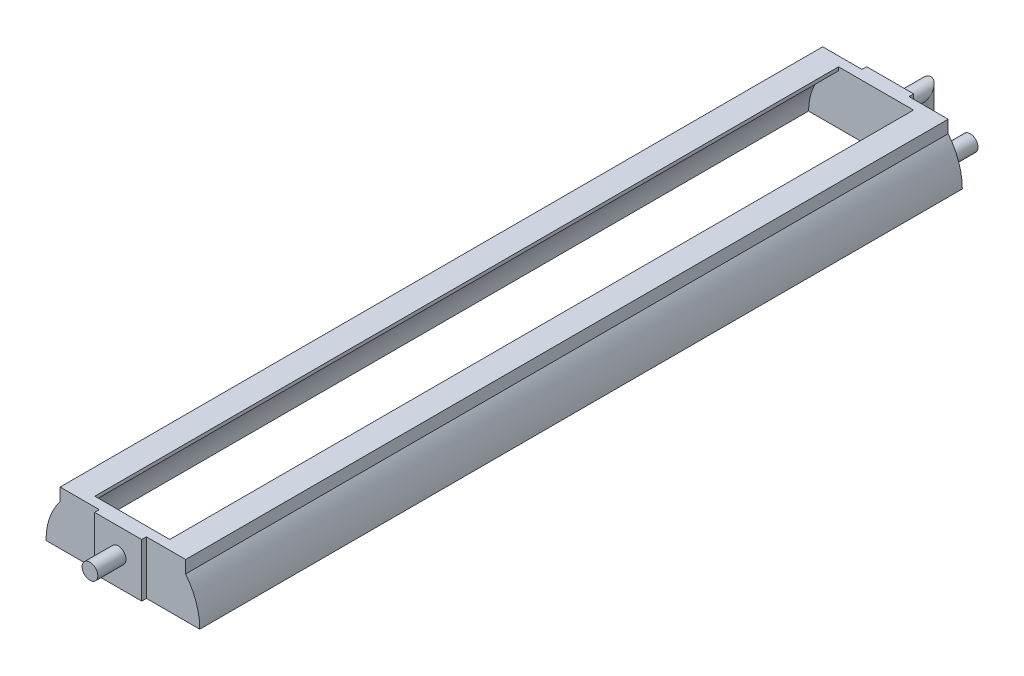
ISO-10303-21;
HEADER;
FILE_DESCRIPTION(('STEP AP214'),'2;1');
FILE_NAME('part.step','',(''),(''),'','','');
FILE_SCHEMA(('AUTOMOTIVE_DESIGN { 1 0 10303 214 1 1 1 1 }'));
ENDSEC;
DATA;
#1=APPLICATION_CONTEXT('core data for automotive mechanical design processes');
#2=APPLICATION_PROTOCOL_DEFINITION('international standard','automotive_design',2000,#1);
#3=PRODUCT_CONTEXT('',#1,'mechanical');
#4=PRODUCT('Part','Part','',(#3));
#5=PRODUCT_RELATED_PRODUCT_CATEGORY('part','',(#4));
#6=PRODUCT_DEFINITION_FORMATION('','',#4);
#7=PRODUCT_DEFINITION_CONTEXT('part definition',#1,'design');
#8=PRODUCT_DEFINITION('design','',#6,#7);
#9=PRODUCT_DEFINITION_SHAPE('','',#8);
#10=(LENGTH_UNIT() NAMED_UNIT(*) SI_UNIT(.MILLI.,.METRE.));
#11=(NAMED_UNIT(*) PLANE_ANGLE_UNIT() SI_UNIT($,.RADIAN.));
#12=(NAMED_UNIT(*) SI_UNIT($,.STERADIAN.) SOLID_ANGLE_UNIT());
#13=UNCERTAINTY_MEASURE_WITH_UNIT(LENGTH_MEASURE(1.E-05),#10,'distance_accuracy_value','');
#14=(GEOMETRIC_REPRESENTATION_CONTEXT(3) GLOBAL_UNCERTAINTY_ASSIGNED_CONTEXT((#13)) GLOBAL_UNIT_ASSIGNED_CONTEXT((#10,
#11,#12)) REPRESENTATION_CONTEXT('',''));
#15=CARTESIAN_POINT('',(0.,0.,0.));
#16=DIRECTION('',(0.,0.,1.));
#17=DIRECTION('',(1.,0.,0.));
#18=AXIS2_PLACEMENT_3D('',#15,#16,#17);
#19=CARTESIAN_POINT('',(0.,-10.5,-136.));
#20=DIRECTION('',(0.,0.,-1.));
#21=DIRECTION('',(-1.,0.,0.));
#22=AXIS2_PLACEMENT_3D('',#19,#20,#21);
#23=PLANE('',#22);
#24=CARTESIAN_POINT('',(0.,-13.,-136.));
#25=DIRECTION('',(0.,0.,1.));
#26=DIRECTION('',(1.,0.,0.));
#27=AXIS2_PLACEMENT_3D('',#24,#25,#26);
#28=CIRCLE('',#27,2.5);
#29=CARTESIAN_POINT('',(2.5,-13.,-136.));
#30=VERTEX_POINT('',#29);
#31=EDGE_CURVE('E12',#30,#30,#28,.T.);
#32=ORIENTED_EDGE('',*,*,#31,.F.);
#33=EDGE_LOOP('',(#32));
#34=FACE_BOUND('',#33,.T.);
#35=CARTESIAN_POINT('',(0.,-13.,-136.));
#36=DIRECTION('',(0.,0.,1.));
#37=DIRECTION('',(1.,0.,0.));
#38=AXIS2_PLACEMENT_3D('',#35,#36,#37);
#39=CIRCLE('',#38,3.);
#40=CARTESIAN_POINT('',(3.,-13.,-136.));
#41=VERTEX_POINT('',#40);
#42=EDGE_CURVE('E59',#41,#41,#39,.T.);
#43=ORIENTED_EDGE('',*,*,#42,.T.);
#44=EDGE_LOOP('',(#43));
#45=FACE_BOUND('',#44,.T.);
#46=ADVANCED_FACE('F45',(#34,#45),#23,.F.);
#47=CARTESIAN_POINT('',(0.,-13.,-131.));
#48=DIRECTION('',(0.,0.,1.));
#49=DIRECTION('',(1.,0.,0.));
#50=AXIS2_PLACEMENT_3D('',#47,#48,#49);
#51=CYLINDRICAL_SURFACE('',#50,2.5);
#52=CARTESIAN_POINT('',(0.,-13.,-138.));
#53=DIRECTION('',(0.,0.,1.));
#54=DIRECTION('',(1.,0.,0.));
#55=AXIS2_PLACEMENT_3D('',#52,#53,#54);
#56=CIRCLE('',#55,2.5);
#57=CARTESIAN_POINT('',(2.5,-13.,-138.));
#58=VERTEX_POINT('',#57);
#59=EDGE_CURVE('E51',#58,#58,#56,.T.);
#60=ORIENTED_EDGE('',*,*,#59,.F.);
#61=EDGE_LOOP('',(#60));
#62=FACE_BOUND('',#61,.T.);
#63=ORIENTED_EDGE('',*,*,#31,.T.);
#64=EDGE_LOOP('',(#63));
#65=FACE_BOUND('',#64,.T.);
#66=ADVANCED_FACE('F74',(#62,#65),#51,.F.);
#67=CARTESIAN_POINT('',(0.,-10.5,-138.));
#68=DIRECTION('',(0.,0.,1.));
#69=DIRECTION('',(1.,0.,0.));
#70=AXIS2_PLACEMENT_3D('',#67,#68,#69);
#71=PLANE('',#70);
#72=CARTESIAN_POINT('',(0.,-13.,-138.));
#73=DIRECTION('',(0.,0.,1.));
#74=DIRECTION('',(1.,0.,0.));
#75=AXIS2_PLACEMENT_3D('',#72,#73,#74);
#76=CIRCLE('',#75,3.);
#77=CARTESIAN_POINT('',(3.,-13.,-138.));
#78=VERTEX_POINT('',#77);
#79=EDGE_CURVE('E55',#78,#78,#76,.T.);
#80=ORIENTED_EDGE('',*,*,#79,.F.);
#81=EDGE_LOOP('',(#80));
#82=FACE_BOUND('',#81,.T.);
#83=ORIENTED_EDGE('',*,*,#59,.T.);
#84=EDGE_LOOP('',(#83));
#85=FACE_BOUND('',#84,.T.);
#86=ADVANCED_FACE('F69',(#82,#85),#71,.F.);
#87=CARTESIAN_POINT('',(0.,-13.,-137.));
#88=DIRECTION('',(0.,0.,1.));
#89=DIRECTION('',(1.,0.,0.));
#90=AXIS2_PLACEMENT_3D('',#87,#88,#89);
#91=TOROIDAL_SURFACE('',#90,3.,1.);
#92=ORIENTED_EDGE('',*,*,#42,.F.);
#93=EDGE_LOOP('',(#92));
#94=FACE_BOUND('',#93,.T.);
#95=ORIENTED_EDGE('',*,*,#79,.T.);
#96=EDGE_LOOP('',(#95));
#97=FACE_BOUND('',#96,.T.);
#98=ADVANCED_FACE('F66',(#94,#97),#91,.T.);
#99=CLOSED_SHELL('',(#46,#66,#86,#98));
#100=MANIFOLD_SOLID_BREP('B2',#99);
#101=CARTESIAN_POINT('',(0.,0.,-123.));
#102=DIRECTION('',(0.,0.,1.));
#103=DIRECTION('',(1.,0.,0.));
#104=AXIS2_PLACEMENT_3D('',#101,#102,#103);
#105=PLANE('',#104);
#106=DIRECTION('',(0.,-1.,0.));
#107=VECTOR('',#106,1.);
#108=CARTESIAN_POINT('',(7.49999999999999,0.,-123.));
#109=LINE('',#108,#107);
#110=CARTESIAN_POINT('',(7.49999999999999,17.,-123.));
#111=VERTEX_POINT('',#110);
#112=CARTESIAN_POINT('',(7.49999999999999,0.,-123.));
#113=VERTEX_POINT('',#112);
#114=EDGE_CURVE('E473',#111,#113,#109,.T.);
#115=ORIENTED_EDGE('',*,*,#114,.T.);
#116=DIRECTION('',(-1.,0.,0.));
#117=VECTOR('',#116,1.);
#118=CARTESIAN_POINT('',(7.49999999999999,0.,-123.));
#119=LINE('',#118,#117);
#120=CARTESIAN_POINT('',(-7.49999999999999,0.,-123.));
#121=VERTEX_POINT('',#120);
#122=EDGE_CURVE('E472',#113,#121,#119,.T.);
#123=ORIENTED_EDGE('',*,*,#122,.T.);
#124=DIRECTION('',(0.,1.,0.));
#125=VECTOR('',#124,1.);
#126=CARTESIAN_POINT('',(-7.49999999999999,17.,-123.));
#127=LINE('',#126,#125);
#128=CARTESIAN_POINT('',(-7.49999999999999,17.,-123.));
#129=VERTEX_POINT('',#128);
#130=EDGE_CURVE('E470',#121,#129,#127,.T.);
#131=ORIENTED_EDGE('',*,*,#130,.T.);
#132=DIRECTION('',(1.,0.,0.));
#133=VECTOR('',#132,1.);
#134=CARTESIAN_POINT('',(7.49999999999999,17.,-123.));
#135=LINE('',#134,#133);
#136=EDGE_CURVE('E462',#129,#111,#135,.T.);
#137=ORIENTED_EDGE('',*,*,#136,.T.);
#138=EDGE_LOOP('',(#115,#123,#131,#137));
#139=FACE_BOUND('',#138,.T.);
#140=CARTESIAN_POINT('',(0.,9.,-123.));
#141=DIRECTION('',(0.,0.,1.));
#142=DIRECTION('',(1.,0.,0.));
#143=AXIS2_PLACEMENT_3D('',#140,#141,#142);
#144=CIRCLE('',#143,2.5);
#145=CARTESIAN_POINT('',(2.5,9.,-123.));
#146=VERTEX_POINT('',#145);
#147=EDGE_CURVE('E43',#146,#146,#144,.F.);
#148=ORIENTED_EDGE('',*,*,#147,.F.);
#149=EDGE_LOOP('',(#148));
#150=FACE_BOUND('',#149,.T.);
#151=ADVANCED_FACE('F107',(#139,#150),#105,.F.);
#152=CARTESIAN_POINT('',(0.,0.,123.));
#153=DIRECTION('',(0.,0.,1.));
#154=DIRECTION('',(1.,0.,0.));
#155=AXIS2_PLACEMENT_3D('',#152,#153,#154);
#156=PLANE('',#155);
#157=DIRECTION('',(0.,-1.,0.));
#158=VECTOR('',#157,1.);
#159=CARTESIAN_POINT('',(7.50000000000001,0.,123.));
#160=LINE('',#159,#158);
#161=CARTESIAN_POINT('',(7.50000000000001,17.,123.));
#162=VERTEX_POINT('',#161);
#163=CARTESIAN_POINT('',(7.50000000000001,0.,123.));
#164=VERTEX_POINT('',#163);
#165=EDGE_CURVE('E250',#162,#164,#160,.T.);
#166=ORIENTED_EDGE('',*,*,#165,.F.);
#167=DIRECTION('',(-1.,0.,0.));
#168=VECTOR('',#167,1.);
#169=CARTESIAN_POINT('',(0.,17.,123.));
#170=LINE('',#169,#168);
#171=CARTESIAN_POINT('',(-7.49999999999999,17.,123.));
#172=VERTEX_POINT('',#171);
#173=EDGE_CURVE('E257',#162,#172,#170,.T.);
#174=ORIENTED_EDGE('',*,*,#173,.T.);
#175=DIRECTION('',(0.,-1.,0.));
#176=VECTOR('',#175,1.);
#177=CARTESIAN_POINT('',(-7.49999999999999,0.,123.));
#178=LINE('',#177,#176);
#179=CARTESIAN_POINT('',(-7.49999999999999,0.,123.));
#180=VERTEX_POINT('',#179);
#181=EDGE_CURVE('E264',#172,#180,#178,.T.);
#182=ORIENTED_EDGE('',*,*,#181,.T.);
#183=DIRECTION('',(1.,0.,0.));
#184=VECTOR('',#183,1.);
#185=CARTESIAN_POINT('',(0.,0.,123.));
#186=LINE('',#185,#184);
#187=EDGE_CURVE('E269',#180,#164,#186,.T.);
#188=ORIENTED_EDGE('',*,*,#187,.T.);
#189=EDGE_LOOP('',(#166,#174,#182,#188));
#190=FACE_BOUND('',#189,.T.);
#191=CARTESIAN_POINT('',(0.,8.9999999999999,123.));
#192=DIRECTION('',(0.,0.,1.));
#193=DIRECTION('',(1.,0.,0.));
#194=AXIS2_PLACEMENT_3D('',#191,#192,#193);
#195=CIRCLE('',#194,2.50384678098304);
#196=CARTESIAN_POINT('',(2.50384678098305,8.9999999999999,123.));
#197=VERTEX_POINT('',#196);
#198=EDGE_CURVE('E274',#197,#197,#195,.T.);
#199=ORIENTED_EDGE('',*,*,#198,.F.);
#200=EDGE_LOOP('',(#199));
#201=FACE_BOUND('',#200,.T.);
#202=ADVANCED_FACE('F266',(#190,#201),#156,.T.);
#203=CARTESIAN_POINT('',(3.49999999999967,-1.87350135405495E-13,121.5));
#204=DIRECTION('',(0.,0.,-1.));
#205=DIRECTION('',(-1.,0.,0.));
#206=AXIS2_PLACEMENT_3D('',#203,#204,#205);
#207=PLANE('',#206);
#208=DIRECTION('',(0.,-1.,0.));
#209=VECTOR('',#208,1.);
#210=CARTESIAN_POINT('',(-7.49999999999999,0.,121.5));
#211=LINE('',#210,#209);
#212=CARTESIAN_POINT('',(-7.49999999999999,17.,121.5));
#213=VERTEX_POINT('',#212);
#214=CARTESIAN_POINT('',(-7.49999999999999,0.,121.5));
#215=VERTEX_POINT('',#214);
#216=EDGE_CURVE('E123',#213,#215,#211,.T.);
#217=ORIENTED_EDGE('',*,*,#216,.F.);
#218=DIRECTION('',(-1.,0.,0.));
#219=VECTOR('',#218,1.);
#220=CARTESIAN_POINT('',(-19.9924225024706,17.,121.5));
#221=LINE('',#220,#219);
#222=CARTESIAN_POINT('',(-19.9924225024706,17.,121.5));
#223=VERTEX_POINT('',#222);
#224=EDGE_CURVE('E303',#213,#223,#221,.T.);
#225=ORIENTED_EDGE('',*,*,#224,.T.);
#226=DIRECTION('',(0.,-1.,0.));
#227=VECTOR('',#226,1.);
#228=CARTESIAN_POINT('',(-19.9924225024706,13.,121.5));
#229=LINE('',#228,#227);
#230=CARTESIAN_POINT('',(-19.9924225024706,13.,121.5));
#231=VERTEX_POINT('',#230);
#232=EDGE_CURVE('E353',#223,#231,#229,.T.);
#233=ORIENTED_EDGE('',*,*,#232,.T.);
#234=CARTESIAN_POINT('',(-3.5,0.,121.5));
#235=DIRECTION('',(0.,0.,1.));
#236=DIRECTION('',(1.,0.,0.));
#237=AXIS2_PLACEMENT_3D('',#234,#235,#236);
#238=CIRCLE('',#237,21.);
#239=CARTESIAN_POINT('',(-24.5,-1.46642216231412E-13,121.5));
#240=VERTEX_POINT('',#239);
#241=EDGE_CURVE('E404',#231,#240,#238,.T.);
#242=ORIENTED_EDGE('',*,*,#241,.T.);
#243=DIRECTION('',(1.,0.,0.));
#244=VECTOR('',#243,1.);
#245=CARTESIAN_POINT('',(-24.5,-1.46642216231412E-13,121.5));
#246=LINE('',#245,#244);
#247=EDGE_CURVE('E397',#240,#215,#246,.T.);
#248=ORIENTED_EDGE('',*,*,#247,.T.);
#249=EDGE_LOOP('',(#217,#225,#233,#242,#248));
#250=FACE_BOUND('',#249,.T.);
#251=ADVANCED_FACE('F513',(#250),#207,.F.);
#252=CARTESIAN_POINT('',(3.4999999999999,0.,-121.5));
#253=DIRECTION('',(0.,0.,1.));
#254=DIRECTION('',(1.,0.,0.));
#255=AXIS2_PLACEMENT_3D('',#252,#253,#254);
#256=PLANE('',#255);
#257=DIRECTION('',(0.,-1.,0.));
#258=VECTOR('',#257,1.);
#259=CARTESIAN_POINT('',(7.49999999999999,0.,-121.5));
#260=LINE('',#259,#258);
#261=CARTESIAN_POINT('',(7.49999999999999,17.,-121.5));
#262=VERTEX_POINT('',#261);
#263=CARTESIAN_POINT('',(7.49999999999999,0.,-121.5));
#264=VERTEX_POINT('',#263);
#265=EDGE_CURVE('E253',#262,#264,#260,.T.);
#266=ORIENTED_EDGE('',*,*,#265,.F.);
#267=DIRECTION('',(1.,0.,0.));
#268=VECTOR('',#267,1.);
#269=CARTESIAN_POINT('',(-19.9924225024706,17.,-121.5));
#270=LINE('',#269,#268);
#271=CARTESIAN_POINT('',(19.9924225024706,17.,-121.5));
#272=VERTEX_POINT('',#271);
#273=EDGE_CURVE('E358',#262,#272,#270,.T.);
#274=ORIENTED_EDGE('',*,*,#273,.T.);
#275=DIRECTION('',(0.,-1.,0.));
#276=VECTOR('',#275,1.);
#277=CARTESIAN_POINT('',(19.9924225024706,17.,-121.5));
#278=LINE('',#277,#276);
#279=CARTESIAN_POINT('',(19.9924225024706,13.,-121.5));
#280=VERTEX_POINT('',#279);
#281=EDGE_CURVE('E357',#272,#280,#278,.T.);
#282=ORIENTED_EDGE('',*,*,#281,.T.);
#283=CARTESIAN_POINT('',(3.4999999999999,0.,-121.5));
#284=DIRECTION('',(0.,0.,-1.));
#285=DIRECTION('',(1.,0.,0.));
#286=AXIS2_PLACEMENT_3D('',#283,#284,#285);
#287=CIRCLE('',#286,21.0000000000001);
#288=CARTESIAN_POINT('',(24.5,0.,-121.5));
#289=VERTEX_POINT('',#288);
#290=EDGE_CURVE('E368',#280,#289,#287,.T.);
#291=ORIENTED_EDGE('',*,*,#290,.T.);
#292=DIRECTION('',(-1.,0.,0.));
#293=VECTOR('',#292,1.);
#294=CARTESIAN_POINT('',(-24.5,0.,-121.5));
#295=LINE('',#294,#293);
#296=EDGE_CURVE('E379',#289,#264,#295,.T.);
#297=ORIENTED_EDGE('',*,*,#296,.T.);
#298=EDGE_LOOP('',(#266,#274,#282,#291,#297));
#299=FACE_BOUND('',#298,.T.);
#300=ADVANCED_FACE('F493',(#299),#256,.F.);
#301=DIRECTION('',(0.,1.,0.));
#302=VECTOR('',#301,1.);
#303=CARTESIAN_POINT('',(-7.49999999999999,17.,-121.5));
#304=LINE('',#303,#302);
#305=CARTESIAN_POINT('',(-7.49999999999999,0.,-121.5));
#306=VERTEX_POINT('',#305);
#307=CARTESIAN_POINT('',(-7.49999999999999,17.,-121.5));
#308=VERTEX_POINT('',#307);
#309=EDGE_CURVE('E393',#306,#308,#304,.T.);
#310=ORIENTED_EDGE('',*,*,#309,.F.);
#311=CARTESIAN_POINT('',(-24.5,0.,-121.5));
#312=VERTEX_POINT('',#311);
#313=EDGE_CURVE('E371',#306,#312,#295,.T.);
#314=ORIENTED_EDGE('',*,*,#313,.T.);
#315=CARTESIAN_POINT('',(-3.50000000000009,0.,-121.5));
#316=DIRECTION('',(0.,0.,-1.));
#317=DIRECTION('',(-1.,0.,0.));
#318=AXIS2_PLACEMENT_3D('',#315,#316,#317);
#319=CIRCLE('',#318,20.9999999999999);
#320=CARTESIAN_POINT('',(-19.9924225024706,13.,-121.5));
#321=VERTEX_POINT('',#320);
#322=EDGE_CURVE('E374',#312,#321,#319,.T.);
#323=ORIENTED_EDGE('',*,*,#322,.T.);
#324=DIRECTION('',(0.,1.,0.));
#325=VECTOR('',#324,1.);
#326=CARTESIAN_POINT('',(-19.9924225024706,13.,-121.5));
#327=LINE('',#326,#325);
#328=CARTESIAN_POINT('',(-19.9924225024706,17.,-121.5));
#329=VERTEX_POINT('',#328);
#330=EDGE_CURVE('E384',#321,#329,#327,.T.);
#331=ORIENTED_EDGE('',*,*,#330,.T.);
#332=EDGE_CURVE('E354',#329,#308,#270,.T.);
#333=ORIENTED_EDGE('',*,*,#332,.T.);
#334=EDGE_LOOP('',(#310,#314,#323,#331,#333));
#335=FACE_BOUND('',#334,.T.);
#336=ADVANCED_FACE('F388',(#335),#256,.F.);
#337=CARTESIAN_POINT('',(-3.5,0.,-118.5));
#338=DIRECTION('',(0.,0.,1.));
#339=DIRECTION('',(1.,0.,0.));
#340=AXIS2_PLACEMENT_3D('',#337,#338,#339);
#341=CYLINDRICAL_SURFACE('',#340,18.);
#342=DIRECTION('',(0.,0.,1.));
#343=VECTOR('',#342,1.);
#344=CARTESIAN_POINT('',(-11.9440829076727,15.8964607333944,-118.5));
#345=LINE('',#344,#343);
#346=CARTESIAN_POINT('',(-11.9440829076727,15.8964607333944,-118.5));
#347=VERTEX_POINT('',#346);
#348=CARTESIAN_POINT('',(-11.9440829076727,15.8964607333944,118.5));
#349=VERTEX_POINT('',#348);
#350=EDGE_CURVE('E336',#347,#349,#345,.T.);
#351=ORIENTED_EDGE('',*,*,#350,.T.);
#352=CARTESIAN_POINT('',(-3.5,0.,118.5));
#353=DIRECTION('',(0.,0.,-1.));
#354=DIRECTION('',(-1.,0.,0.));
#355=AXIS2_PLACEMENT_3D('',#352,#353,#354);
#356=CIRCLE('',#355,18.);
#357=CARTESIAN_POINT('',(-21.5,0.,118.5));
#358=VERTEX_POINT('',#357);
#359=EDGE_CURVE('E335',#358,#349,#356,.T.);
#360=ORIENTED_EDGE('',*,*,#359,.F.);
#361=DIRECTION('',(0.,0.,1.));
#362=VECTOR('',#361,1.);
#363=CARTESIAN_POINT('',(-21.5,0.,-118.5));
#364=LINE('',#363,#362);
#365=CARTESIAN_POINT('',(-21.5,0.,-118.5));
#366=VERTEX_POINT('',#365);
#367=EDGE_CURVE('E116',#366,#358,#364,.T.);
#368=ORIENTED_EDGE('',*,*,#367,.F.);
#369=CARTESIAN_POINT('',(-3.5,0.,-118.5));
#370=DIRECTION('',(0.,0.,-1.));
#371=DIRECTION('',(-1.,0.,0.));
#372=AXIS2_PLACEMENT_3D('',#369,#370,#371);
#373=CIRCLE('',#372,18.);
#374=EDGE_CURVE('E328',#366,#347,#373,.T.);
#375=ORIENTED_EDGE('',*,*,#374,.T.);
#376=EDGE_LOOP('',(#351,#360,#368,#375));
#377=FACE_BOUND('',#376,.T.);
#378=ADVANCED_FACE('F109',(#377),#341,.F.);
#379=CARTESIAN_POINT('',(-21.5,0.,-118.5));
#380=DIRECTION('',(0.,-1.,0.));
#381=DIRECTION('',(0.,0.,-1.));
#382=AXIS2_PLACEMENT_3D('',#379,#380,#381);
#383=PLANE('',#382);
#384=DIRECTION('',(-1.,0.,0.));
#385=VECTOR('',#384,1.);
#386=CARTESIAN_POINT('',(-24.5,0.,-118.5));
#387=LINE('',#386,#385);
#388=CARTESIAN_POINT('',(21.5,0.,-118.5));
#389=VERTEX_POINT('',#388);
#390=EDGE_CURVE('E422',#389,#366,#387,.T.);
#391=ORIENTED_EDGE('',*,*,#390,.T.);
#392=ORIENTED_EDGE('',*,*,#367,.T.);
#393=DIRECTION('',(1.,0.,0.));
#394=VECTOR('',#393,1.);
#395=CARTESIAN_POINT('',(-24.5,-1.46642216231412E-13,118.5));
#396=LINE('',#395,#394);
#397=CARTESIAN_POINT('',(21.5,0.,118.5));
#398=VERTEX_POINT('',#397);
#399=EDGE_CURVE('E318',#358,#398,#396,.T.);
#400=ORIENTED_EDGE('',*,*,#399,.T.);
#401=DIRECTION('',(0.,0.,1.));
#402=VECTOR('',#401,1.);
#403=CARTESIAN_POINT('',(21.5,0.,-118.5));
#404=LINE('',#403,#402);
#405=EDGE_CURVE('E323',#389,#398,#404,.T.);
#406=ORIENTED_EDGE('',*,*,#405,.F.);
#407=EDGE_LOOP('',(#391,#392,#400,#406));
#408=FACE_BOUND('',#407,.T.);
#409=DIRECTION('',(0.,0.,1.));
#410=VECTOR('',#409,1.);
#411=CARTESIAN_POINT('',(-24.5,0.,-118.5));
#412=LINE('',#411,#410);
#413=EDGE_CURVE('E345',#312,#240,#412,.T.);
#414=ORIENTED_EDGE('',*,*,#413,.F.);
#415=ORIENTED_EDGE('',*,*,#313,.F.);
#416=DIRECTION('',(0.,0.,1.));
#417=VECTOR('',#416,1.);
#418=CARTESIAN_POINT('',(-7.49999999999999,0.,-123.));
#419=LINE('',#418,#417);
#420=EDGE_CURVE('E483',#121,#306,#419,.T.);
#421=ORIENTED_EDGE('',*,*,#420,.F.);
#422=ORIENTED_EDGE('',*,*,#122,.F.);
#423=DIRECTION('',(0.,0.,1.));
#424=VECTOR('',#423,1.);
#425=CARTESIAN_POINT('',(7.49999999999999,0.,-123.));
#426=LINE('',#425,#424);
#427=EDGE_CURVE('E429',#113,#264,#426,.T.);
#428=ORIENTED_EDGE('',*,*,#427,.T.);
#429=ORIENTED_EDGE('',*,*,#296,.F.);
#430=DIRECTION('',(0.,0.,-1.));
#431=VECTOR('',#430,1.);
#432=CARTESIAN_POINT('',(24.5,0.,121.5));
#433=LINE('',#432,#431);
#434=CARTESIAN_POINT('',(24.5,0.,121.5));
#435=VERTEX_POINT('',#434);
#436=EDGE_CURVE('E324',#435,#289,#433,.T.);
#437=ORIENTED_EDGE('',*,*,#436,.F.);
#438=CARTESIAN_POINT('',(7.50000000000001,0.,121.5));
#439=VERTEX_POINT('',#438);
#440=EDGE_CURVE('E450',#439,#435,#246,.T.);
#441=ORIENTED_EDGE('',*,*,#440,.F.);
#442=DIRECTION('',(0.,0.,-1.));
#443=VECTOR('',#442,1.);
#444=CARTESIAN_POINT('',(7.50000000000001,0.,123.));
#445=LINE('',#444,#443);
#446=EDGE_CURVE('E279',#164,#439,#445,.T.);
#447=ORIENTED_EDGE('',*,*,#446,.F.);
#448=ORIENTED_EDGE('',*,*,#187,.F.);
#449=DIRECTION('',(0.,0.,-1.));
#450=VECTOR('',#449,1.);
#451=CARTESIAN_POINT('',(-7.49999999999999,0.,123.));
#452=LINE('',#451,#450);
#453=EDGE_CURVE('E290',#180,#215,#452,.T.);
#454=ORIENTED_EDGE('',*,*,#453,.T.);
#455=ORIENTED_EDGE('',*,*,#247,.F.);
#456=EDGE_LOOP('',(#414,#415,#421,#422,#428,#429,#437,#441,#447,#448,#454,#455));
#457=FACE_BOUND('',#456,.T.);
#458=ADVANCED_FACE('F396',(#408,#457),#383,.T.);
#459=CARTESIAN_POINT('',(-3.5,0.,-118.5));
#460=DIRECTION('',(0.,0.,1.));
#461=DIRECTION('',(1.,0.,0.));
#462=AXIS2_PLACEMENT_3D('',#459,#460,#461);
#463=CYLINDRICAL_SURFACE('',#462,21.);
#464=ORIENTED_EDGE('',*,*,#413,.T.);
#465=ORIENTED_EDGE('',*,*,#241,.F.);
#466=DIRECTION('',(0.,0.,1.));
#467=VECTOR('',#466,1.);
#468=CARTESIAN_POINT('',(-19.9924225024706,13.,-118.5));
#469=LINE('',#468,#467);
#470=EDGE_CURVE('E401',#321,#231,#469,.T.);
#471=ORIENTED_EDGE('',*,*,#470,.F.);
#472=ORIENTED_EDGE('',*,*,#322,.F.);
#473=EDGE_LOOP('',(#464,#465,#471,#472));
#474=FACE_BOUND('',#473,.T.);
#475=ADVANCED_FACE('F403',(#474),#463,.T.);
#476=CARTESIAN_POINT('',(-19.9924225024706,13.,-118.5));
#477=DIRECTION('',(-1.,0.,0.));
#478=DIRECTION('',(0.,0.,1.));
#479=AXIS2_PLACEMENT_3D('',#476,#477,#478);
#480=PLANE('',#479);
#481=ORIENTED_EDGE('',*,*,#470,.T.);
#482=ORIENTED_EDGE('',*,*,#232,.F.);
#483=DIRECTION('',(0.,0.,1.));
#484=VECTOR('',#483,1.);
#485=CARTESIAN_POINT('',(-19.9924225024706,17.,-118.5));
#486=LINE('',#485,#484);
#487=EDGE_CURVE('E341',#329,#223,#486,.T.);
#488=ORIENTED_EDGE('',*,*,#487,.F.);
#489=ORIENTED_EDGE('',*,*,#330,.F.);
#490=EDGE_LOOP('',(#481,#482,#488,#489));
#491=FACE_BOUND('',#490,.T.);
#492=ADVANCED_FACE('F570',(#491),#480,.T.);
#493=CARTESIAN_POINT('',(-11.9440829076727,17.,-118.5));
#494=DIRECTION('',(0.,1.,0.));
#495=DIRECTION('',(0.,0.,1.));
#496=AXIS2_PLACEMENT_3D('',#493,#494,#495);
#497=PLANE('',#496);
#498=ORIENTED_EDGE('',*,*,#332,.F.);
#499=ORIENTED_EDGE('',*,*,#487,.T.);
#500=ORIENTED_EDGE('',*,*,#224,.F.);
#501=DIRECTION('',(0.,0.,-1.));
#502=VECTOR('',#501,1.);
#503=CARTESIAN_POINT('',(-7.49999999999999,17.,123.));
#504=LINE('',#503,#502);
#505=EDGE_CURVE('E254',#172,#213,#504,.T.);
#506=ORIENTED_EDGE('',*,*,#505,.F.);
#507=ORIENTED_EDGE('',*,*,#173,.F.);
#508=DIRECTION('',(0.,0.,-1.));
#509=VECTOR('',#508,1.);
#510=CARTESIAN_POINT('',(7.50000000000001,17.,123.));
#511=LINE('',#510,#509);
#512=CARTESIAN_POINT('',(7.50000000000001,17.,121.5));
#513=VERTEX_POINT('',#512);
#514=EDGE_CURVE('E245',#162,#513,#511,.T.);
#515=ORIENTED_EDGE('',*,*,#514,.T.);
#516=CARTESIAN_POINT('',(19.9924225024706,17.,121.5));
#517=VERTEX_POINT('',#516);
#518=EDGE_CURVE('E131',#517,#513,#221,.T.);
#519=ORIENTED_EDGE('',*,*,#518,.F.);
#520=DIRECTION('',(0.,0.,-1.));
#521=VECTOR('',#520,1.);
#522=CARTESIAN_POINT('',(19.9924225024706,17.,121.5));
#523=LINE('',#522,#521);
#524=EDGE_CURVE('E497',#517,#272,#523,.T.);
#525=ORIENTED_EDGE('',*,*,#524,.T.);
#526=ORIENTED_EDGE('',*,*,#273,.F.);
#527=DIRECTION('',(0.,0.,1.));
#528=VECTOR('',#527,1.);
#529=CARTESIAN_POINT('',(7.49999999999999,17.,-123.));
#530=LINE('',#529,#528);
#531=EDGE_CURVE('E458',#111,#262,#530,.T.);
#532=ORIENTED_EDGE('',*,*,#531,.F.);
#533=ORIENTED_EDGE('',*,*,#136,.F.);
#534=DIRECTION('',(0.,0.,1.));
#535=VECTOR('',#534,1.);
#536=CARTESIAN_POINT('',(-7.49999999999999,17.,-123.));
#537=LINE('',#536,#535);
#538=EDGE_CURVE('E461',#129,#308,#537,.T.);
#539=ORIENTED_EDGE('',*,*,#538,.T.);
#540=EDGE_LOOP('',(#498,#499,#500,#506,#507,#515,#519,#525,#526,#532,#533,#539));
#541=FACE_BOUND('',#540,.T.);
#542=DIRECTION('',(0.,0.,1.));
#543=VECTOR('',#542,1.);
#544=CARTESIAN_POINT('',(-11.9440829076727,17.,-118.5));
#545=LINE('',#544,#543);
#546=CARTESIAN_POINT('',(-11.9440829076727,17.,-118.5));
#547=VERTEX_POINT('',#546);
#548=CARTESIAN_POINT('',(-11.9440829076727,17.,118.5));
#549=VERTEX_POINT('',#548);
#550=EDGE_CURVE('E338',#547,#549,#545,.T.);
#551=ORIENTED_EDGE('',*,*,#550,.F.);
#552=DIRECTION('',(1.,0.,0.));
#553=VECTOR('',#552,1.);
#554=CARTESIAN_POINT('',(-19.9924225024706,17.,-118.5));
#555=LINE('',#554,#553);
#556=CARTESIAN_POINT('',(11.9440829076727,17.,-118.5));
#557=VERTEX_POINT('',#556);
#558=EDGE_CURVE('E426',#547,#557,#555,.T.);
#559=ORIENTED_EDGE('',*,*,#558,.T.);
#560=DIRECTION('',(0.,0.,1.));
#561=VECTOR('',#560,1.);
#562=CARTESIAN_POINT('',(11.9440829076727,17.,-118.5));
#563=LINE('',#562,#561);
#564=CARTESIAN_POINT('',(11.9440829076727,17.,118.5));
#565=VERTEX_POINT('',#564);
#566=EDGE_CURVE('E443',#557,#565,#563,.T.);
#567=ORIENTED_EDGE('',*,*,#566,.T.);
#568=DIRECTION('',(-1.,0.,0.));
#569=VECTOR('',#568,1.);
#570=CARTESIAN_POINT('',(-19.9924225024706,17.,118.5));
#571=LINE('',#570,#569);
#572=EDGE_CURVE('E322',#565,#549,#571,.T.);
#573=ORIENTED_EDGE('',*,*,#572,.T.);
#574=EDGE_LOOP('',(#551,#559,#567,#573));
#575=FACE_BOUND('',#574,.T.);
#576=ADVANCED_FACE('F259',(#541,#575),#497,.T.);
#577=CARTESIAN_POINT('',(-11.9440829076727,17.,-118.5));
#578=DIRECTION('',(1.,0.,0.));
#579=DIRECTION('',(0.,0.,-1.));
#580=AXIS2_PLACEMENT_3D('',#577,#578,#579);
#581=PLANE('',#580);
#582=ORIENTED_EDGE('',*,*,#550,.T.);
#583=DIRECTION('',(0.,1.,0.));
#584=VECTOR('',#583,1.);
#585=CARTESIAN_POINT('',(-11.9440829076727,17.,118.5));
#586=LINE('',#585,#584);
#587=EDGE_CURVE('E331',#349,#549,#586,.T.);
#588=ORIENTED_EDGE('',*,*,#587,.F.);
#589=ORIENTED_EDGE('',*,*,#350,.F.);
#590=DIRECTION('',(0.,1.,0.));
#591=VECTOR('',#590,1.);
#592=CARTESIAN_POINT('',(-11.9440829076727,17.,-118.5));
#593=LINE('',#592,#591);
#594=EDGE_CURVE('E410',#347,#547,#593,.T.);
#595=ORIENTED_EDGE('',*,*,#594,.T.);
#596=EDGE_LOOP('',(#582,#588,#589,#595));
#597=FACE_BOUND('',#596,.T.);
#598=ADVANCED_FACE('F561',(#597),#581,.T.);
#599=CARTESIAN_POINT('',(3.49999999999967,-1.87350135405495E-13,121.5));
#600=DIRECTION('',(0.,0.,-1.));
#601=DIRECTION('',(-1.,0.,0.));
#602=AXIS2_PLACEMENT_3D('',#599,#600,#601);
#603=CYLINDRICAL_SURFACE('',#602,21.0000000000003);
#604=ORIENTED_EDGE('',*,*,#436,.T.);
#605=ORIENTED_EDGE('',*,*,#290,.F.);
#606=DIRECTION('',(0.,0.,-1.));
#607=VECTOR('',#606,1.);
#608=CARTESIAN_POINT('',(19.9924225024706,13.,121.5));
#609=LINE('',#608,#607);
#610=CARTESIAN_POINT('',(19.9924225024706,13.,121.5));
#611=VERTEX_POINT('',#610);
#612=EDGE_CURVE('E501',#611,#280,#609,.T.);
#613=ORIENTED_EDGE('',*,*,#612,.F.);
#614=CARTESIAN_POINT('',(3.49999999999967,-1.87350135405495E-13,121.5));
#615=DIRECTION('',(0.,0.,1.));
#616=DIRECTION('',(-1.,0.,0.));
#617=AXIS2_PLACEMENT_3D('',#614,#615,#616);
#618=CIRCLE('',#617,21.0000000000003);
#619=EDGE_CURVE('E452',#435,#611,#618,.T.);
#620=ORIENTED_EDGE('',*,*,#619,.F.);
#621=EDGE_LOOP('',(#604,#605,#613,#620));
#622=FACE_BOUND('',#621,.T.);
#623=ADVANCED_FACE('F506',(#622),#603,.T.);
#624=CARTESIAN_POINT('',(19.9924225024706,17.,121.5));
#625=DIRECTION('',(-1.,0.,0.));
#626=DIRECTION('',(0.,0.,1.));
#627=AXIS2_PLACEMENT_3D('',#624,#625,#626);
#628=PLANE('',#627);
#629=ORIENTED_EDGE('',*,*,#612,.T.);
#630=ORIENTED_EDGE('',*,*,#281,.F.);
#631=ORIENTED_EDGE('',*,*,#524,.F.);
#632=DIRECTION('',(0.,1.,0.));
#633=VECTOR('',#632,1.);
#634=CARTESIAN_POINT('',(19.9924225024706,17.,121.5));
#635=LINE('',#634,#633);
#636=EDGE_CURVE('E306',#611,#517,#635,.T.);
#637=ORIENTED_EDGE('',*,*,#636,.F.);
#638=EDGE_LOOP('',(#629,#630,#631,#637));
#639=FACE_BOUND('',#638,.T.);
#640=ADVANCED_FACE('F502',(#639),#628,.F.);
#641=ORIENTED_EDGE('',*,*,#518,.T.);
#642=DIRECTION('',(0.,-1.,0.));
#643=VECTOR('',#642,1.);
#644=CARTESIAN_POINT('',(7.50000000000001,0.,121.5));
#645=LINE('',#644,#643);
#646=EDGE_CURVE('E251',#513,#439,#645,.T.);
#647=ORIENTED_EDGE('',*,*,#646,.T.);
#648=ORIENTED_EDGE('',*,*,#440,.T.);
#649=ORIENTED_EDGE('',*,*,#619,.T.);
#650=ORIENTED_EDGE('',*,*,#636,.T.);
#651=EDGE_LOOP('',(#641,#647,#648,#649,#650));
#652=FACE_BOUND('',#651,.T.);
#653=ADVANCED_FACE('F509',(#652),#207,.F.);
#654=CARTESIAN_POINT('',(3.49999999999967,-1.87350135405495E-13,118.5));
#655=DIRECTION('',(0.,0.,-1.));
#656=DIRECTION('',(-1.,0.,0.));
#657=AXIS2_PLACEMENT_3D('',#654,#655,#656);
#658=PLANE('',#657);
#659=CARTESIAN_POINT('',(3.5,0.,118.5));
#660=DIRECTION('',(0.,0.,-1.));
#661=DIRECTION('',(1.,0.,0.));
#662=AXIS2_PLACEMENT_3D('',#659,#660,#661);
#663=CIRCLE('',#662,18.);
#664=CARTESIAN_POINT('',(11.9440829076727,15.8964607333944,118.5));
#665=VERTEX_POINT('',#664);
#666=EDGE_CURVE('E435',#665,#398,#663,.T.);
#667=ORIENTED_EDGE('',*,*,#666,.T.);
#668=ORIENTED_EDGE('',*,*,#399,.F.);
#669=ORIENTED_EDGE('',*,*,#359,.T.);
#670=ORIENTED_EDGE('',*,*,#587,.T.);
#671=ORIENTED_EDGE('',*,*,#572,.F.);
#672=DIRECTION('',(0.,-1.,0.));
#673=VECTOR('',#672,1.);
#674=CARTESIAN_POINT('',(11.9440829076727,17.,118.5));
#675=LINE('',#674,#673);
#676=EDGE_CURVE('E432',#565,#665,#675,.T.);
#677=ORIENTED_EDGE('',*,*,#676,.T.);
#678=EDGE_LOOP('',(#667,#668,#669,#670,#671,#677));
#679=FACE_BOUND('',#678,.T.);
#680=ADVANCED_FACE('F511',(#679),#658,.T.);
#681=CARTESIAN_POINT('',(3.5,0.,-118.5));
#682=DIRECTION('',(0.,0.,1.));
#683=DIRECTION('',(1.,0.,0.));
#684=AXIS2_PLACEMENT_3D('',#681,#682,#683);
#685=CYLINDRICAL_SURFACE('',#684,18.);
#686=ORIENTED_EDGE('',*,*,#405,.T.);
#687=ORIENTED_EDGE('',*,*,#666,.F.);
#688=DIRECTION('',(0.,0.,1.));
#689=VECTOR('',#688,1.);
#690=CARTESIAN_POINT('',(11.9440829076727,15.8964607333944,-118.5));
#691=LINE('',#690,#689);
#692=CARTESIAN_POINT('',(11.9440829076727,15.8964607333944,-118.5));
#693=VERTEX_POINT('',#692);
#694=EDGE_CURVE('E445',#693,#665,#691,.T.);
#695=ORIENTED_EDGE('',*,*,#694,.F.);
#696=CARTESIAN_POINT('',(3.5,0.,-118.5));
#697=DIRECTION('',(0.,0.,-1.));
#698=DIRECTION('',(1.,0.,0.));
#699=AXIS2_PLACEMENT_3D('',#696,#697,#698);
#700=CIRCLE('',#699,18.);
#701=EDGE_CURVE('E441',#693,#389,#700,.T.);
#702=ORIENTED_EDGE('',*,*,#701,.T.);
#703=EDGE_LOOP('',(#686,#687,#695,#702));
#704=FACE_BOUND('',#703,.T.);
#705=ADVANCED_FACE('F519',(#704),#685,.F.);
#706=CARTESIAN_POINT('',(11.9440829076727,17.,-118.5));
#707=DIRECTION('',(-1.,0.,0.));
#708=DIRECTION('',(0.,0.,1.));
#709=AXIS2_PLACEMENT_3D('',#706,#707,#708);
#710=PLANE('',#709);
#711=ORIENTED_EDGE('',*,*,#694,.T.);
#712=ORIENTED_EDGE('',*,*,#676,.F.);
#713=ORIENTED_EDGE('',*,*,#566,.F.);
#714=DIRECTION('',(0.,-1.,0.));
#715=VECTOR('',#714,1.);
#716=CARTESIAN_POINT('',(11.9440829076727,17.,-118.5));
#717=LINE('',#716,#715);
#718=EDGE_CURVE('E438',#557,#693,#717,.T.);
#719=ORIENTED_EDGE('',*,*,#718,.T.);
#720=EDGE_LOOP('',(#711,#712,#713,#719));
#721=FACE_BOUND('',#720,.T.);
#722=ADVANCED_FACE('F546',(#721),#710,.T.);
#723=CARTESIAN_POINT('',(3.4999999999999,0.,-118.5));
#724=DIRECTION('',(0.,0.,1.));
#725=DIRECTION('',(1.,0.,0.));
#726=AXIS2_PLACEMENT_3D('',#723,#724,#725);
#727=PLANE('',#726);
#728=ORIENTED_EDGE('',*,*,#594,.F.);
#729=ORIENTED_EDGE('',*,*,#374,.F.);
#730=ORIENTED_EDGE('',*,*,#390,.F.);
#731=ORIENTED_EDGE('',*,*,#701,.F.);
#732=ORIENTED_EDGE('',*,*,#718,.F.);
#733=ORIENTED_EDGE('',*,*,#558,.F.);
#734=EDGE_LOOP('',(#728,#729,#730,#731,#732,#733));
#735=FACE_BOUND('',#734,.T.);
#736=ADVANCED_FACE('F421',(#735),#727,.T.);
#737=CARTESIAN_POINT('',(7.49999999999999,0.,-123.));
#738=DIRECTION('',(-1.,0.,0.));
#739=DIRECTION('',(0.,0.,1.));
#740=AXIS2_PLACEMENT_3D('',#737,#738,#739);
#741=PLANE('',#740);
#742=ORIENTED_EDGE('',*,*,#265,.T.);
#743=ORIENTED_EDGE('',*,*,#427,.F.);
#744=ORIENTED_EDGE('',*,*,#114,.F.);
#745=ORIENTED_EDGE('',*,*,#531,.T.);
#746=EDGE_LOOP('',(#742,#743,#744,#745));
#747=FACE_BOUND('',#746,.T.);
#748=ADVANCED_FACE('F490',(#747),#741,.F.);
#749=CARTESIAN_POINT('',(-7.49999999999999,17.,-123.));
#750=DIRECTION('',(1.,0.,0.));
#751=DIRECTION('',(0.,0.,-1.));
#752=AXIS2_PLACEMENT_3D('',#749,#750,#751);
#753=PLANE('',#752);
#754=ORIENTED_EDGE('',*,*,#309,.T.);
#755=ORIENTED_EDGE('',*,*,#538,.F.);
#756=ORIENTED_EDGE('',*,*,#130,.F.);
#757=ORIENTED_EDGE('',*,*,#420,.T.);
#758=EDGE_LOOP('',(#754,#755,#756,#757));
#759=FACE_BOUND('',#758,.T.);
#760=ADVANCED_FACE('F537',(#759),#753,.F.);
#761=CARTESIAN_POINT('',(7.50000000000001,0.,123.));
#762=DIRECTION('',(1.,0.,0.));
#763=DIRECTION('',(0.,0.,-1.));
#764=AXIS2_PLACEMENT_3D('',#761,#762,#763);
#765=PLANE('',#764);
#766=ORIENTED_EDGE('',*,*,#646,.F.);
#767=ORIENTED_EDGE('',*,*,#514,.F.);
#768=ORIENTED_EDGE('',*,*,#165,.T.);
#769=ORIENTED_EDGE('',*,*,#446,.T.);
#770=EDGE_LOOP('',(#766,#767,#768,#769));
#771=FACE_BOUND('',#770,.T.);
#772=ADVANCED_FACE('F247',(#771),#765,.T.);
#773=CARTESIAN_POINT('',(-7.49999999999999,0.,123.));
#774=DIRECTION('',(1.,0.,0.));
#775=DIRECTION('',(0.,0.,-1.));
#776=AXIS2_PLACEMENT_3D('',#773,#774,#775);
#777=PLANE('',#776);
#778=ORIENTED_EDGE('',*,*,#216,.T.);
#779=ORIENTED_EDGE('',*,*,#453,.F.);
#780=ORIENTED_EDGE('',*,*,#181,.F.);
#781=ORIENTED_EDGE('',*,*,#505,.T.);
#782=EDGE_LOOP('',(#778,#779,#780,#781));
#783=FACE_BOUND('',#782,.T.);
#784=ADVANCED_FACE('F605',(#783),#777,.F.);
#785=CARTESIAN_POINT('',(0.,8.9999999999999,132.));
#786=DIRECTION('',(0.,0.,-1.));
#787=DIRECTION('',(-1.,0.,0.));
#788=AXIS2_PLACEMENT_3D('',#785,#786,#787);
#789=CYLINDRICAL_SURFACE('',#788,2.50384678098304);
#790=CARTESIAN_POINT('',(0.,8.9999999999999,132.));
#791=DIRECTION('',(0.,0.,1.));
#792=DIRECTION('',(1.,0.,0.));
#793=AXIS2_PLACEMENT_3D('',#790,#791,#792);
#794=CIRCLE('',#793,2.50384678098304);
#795=CARTESIAN_POINT('',(2.50384678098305,8.9999999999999,132.));
#796=VERTEX_POINT('',#795);
#797=EDGE_CURVE('E287',#796,#796,#794,.T.);
#798=ORIENTED_EDGE('',*,*,#797,.F.);
#799=EDGE_LOOP('',(#798));
#800=FACE_BOUND('',#799,.T.);
#801=ORIENTED_EDGE('',*,*,#198,.T.);
#802=EDGE_LOOP('',(#801));
#803=FACE_BOUND('',#802,.T.);
#804=ADVANCED_FACE('F608',(#800,#803),#789,.T.);
#805=CARTESIAN_POINT('',(0.,8.9999999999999,132.));
#806=DIRECTION('',(0.,0.,1.));
#807=DIRECTION('',(1.,0.,0.));
#808=AXIS2_PLACEMENT_3D('',#805,#806,#807);
#809=PLANE('',#808);
#810=ORIENTED_EDGE('',*,*,#797,.T.);
#811=EDGE_LOOP('',(#810));
#812=FACE_BOUND('',#811,.T.);
#813=ADVANCED_FACE('F612',(#812),#809,.T.);
#814=CARTESIAN_POINT('',(0.,9.,-131.));
#815=DIRECTION('',(0.,0.,1.));
#816=DIRECTION('',(1.,0.,0.));
#817=AXIS2_PLACEMENT_3D('',#814,#815,#816);
#818=CYLINDRICAL_SURFACE('',#817,2.5);
#819=CARTESIAN_POINT('',(0.,9.,-133.5));
#820=DIRECTION('',(0.,-0.707106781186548,-0.707106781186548));
#821=DIRECTION('',(0.,-0.707106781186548,0.707106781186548));
#822=AXIS2_PLACEMENT_3D('',#819,#820,#821);
#823=ELLIPSE('',#822,3.53553390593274,2.5);
#824=CARTESIAN_POINT('',(0.,6.5,-131.));
#825=VERTEX_POINT('',#824);
#826=EDGE_CURVE('E111',#825,#825,#823,.T.);
#827=ORIENTED_EDGE('',*,*,#826,.F.);
#828=EDGE_LOOP('',(#827));
#829=FACE_BOUND('',#828,.T.);
#830=ORIENTED_EDGE('',*,*,#147,.T.);
#831=EDGE_LOOP('',(#830));
#832=FACE_BOUND('',#831,.T.);
#833=ADVANCED_FACE('F621',(#829,#832),#818,.T.);
#834=CARTESIAN_POINT('',(0.,-13.,-133.5));
#835=DIRECTION('',(0.,0.,-1.));
#836=DIRECTION('',(-1.,0.,0.));
#837=AXIS2_PLACEMENT_3D('',#834,#835,#836);
#838=CYLINDRICAL_SURFACE('',#837,2.5);
#839=CARTESIAN_POINT('',(0.,-13.,-148.5));
#840=DIRECTION('',(0.,0.,-1.));
#841=DIRECTION('',(-1.,0.,0.));
#842=AXIS2_PLACEMENT_3D('',#839,#840,#841);
#843=CIRCLE('',#842,2.5);
#844=CARTESIAN_POINT('',(-2.5,-13.,-148.5));
#845=VERTEX_POINT('',#844);
#846=EDGE_CURVE('E828',#845,#845,#843,.T.);
#847=ORIENTED_EDGE('',*,*,#846,.F.);
#848=EDGE_LOOP('',(#847));
#849=FACE_BOUND('',#848,.T.);
#850=CARTESIAN_POINT('',(0.,-13.,-133.5));
#851=DIRECTION('',(0.,-0.707106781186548,-0.707106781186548));
#852=DIRECTION('',(0.,-0.707106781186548,0.707106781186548));
#853=AXIS2_PLACEMENT_3D('',#850,#851,#852);
#854=ELLIPSE('',#853,3.53553390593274,2.5);
#855=CARTESIAN_POINT('',(0.,-15.5,-131.));
#856=VERTEX_POINT('',#855);
#857=EDGE_CURVE('E829',#856,#856,#854,.F.);
#858=ORIENTED_EDGE('',*,*,#857,.F.);
#859=EDGE_LOOP('',(#858));
#860=FACE_BOUND('',#859,.T.);
#861=ADVANCED_FACE('F637',(#849,#860),#838,.T.);
#862=CARTESIAN_POINT('',(0.,9.,-133.5));
#863=DIRECTION('',(0.,-1.,0.));
#864=DIRECTION('',(0.,0.,-1.));
#865=AXIS2_PLACEMENT_3D('',#862,#863,#864);
#866=CYLINDRICAL_SURFACE('',#865,2.5);
#867=ORIENTED_EDGE('',*,*,#857,.T.);
#868=EDGE_LOOP('',(#867));
#869=FACE_BOUND('',#868,.T.);
#870=ORIENTED_EDGE('',*,*,#826,.T.);
#871=EDGE_LOOP('',(#870));
#872=FACE_BOUND('',#871,.T.);
#873=ADVANCED_FACE('F647',(#869,#872),#866,.T.);
#874=CARTESIAN_POINT('',(0.,-13.,-148.5));
#875=DIRECTION('',(0.,0.,-1.));
#876=DIRECTION('',(-1.,0.,0.));
#877=AXIS2_PLACEMENT_3D('',#874,#875,#876);
#878=PLANE('',#877);
#879=ORIENTED_EDGE('',*,*,#846,.T.);
#880=EDGE_LOOP('',(#879));
#881=FACE_BOUND('',#880,.T.);
#882=ADVANCED_FACE('F657',(#881),#878,.T.);
#883=CLOSED_SHELL('',(#151,#202,#251,#300,#336,#378,#458,#475,#492,#576,#598,#623,#640,#653,
#680,#705,#722,#736,#748,#760,#772,#784,#804,#813,#833,#861,#873,#882));
#884=MANIFOLD_SOLID_BREP('B7',#883);
#885=ADVANCED_BREP_SHAPE_REPRESENTATION('',(#18,#100,#884),#14);
#886=SHAPE_DEFINITION_REPRESENTATION(#9,#885);
ENDSEC;
END-ISO-10303-21;
